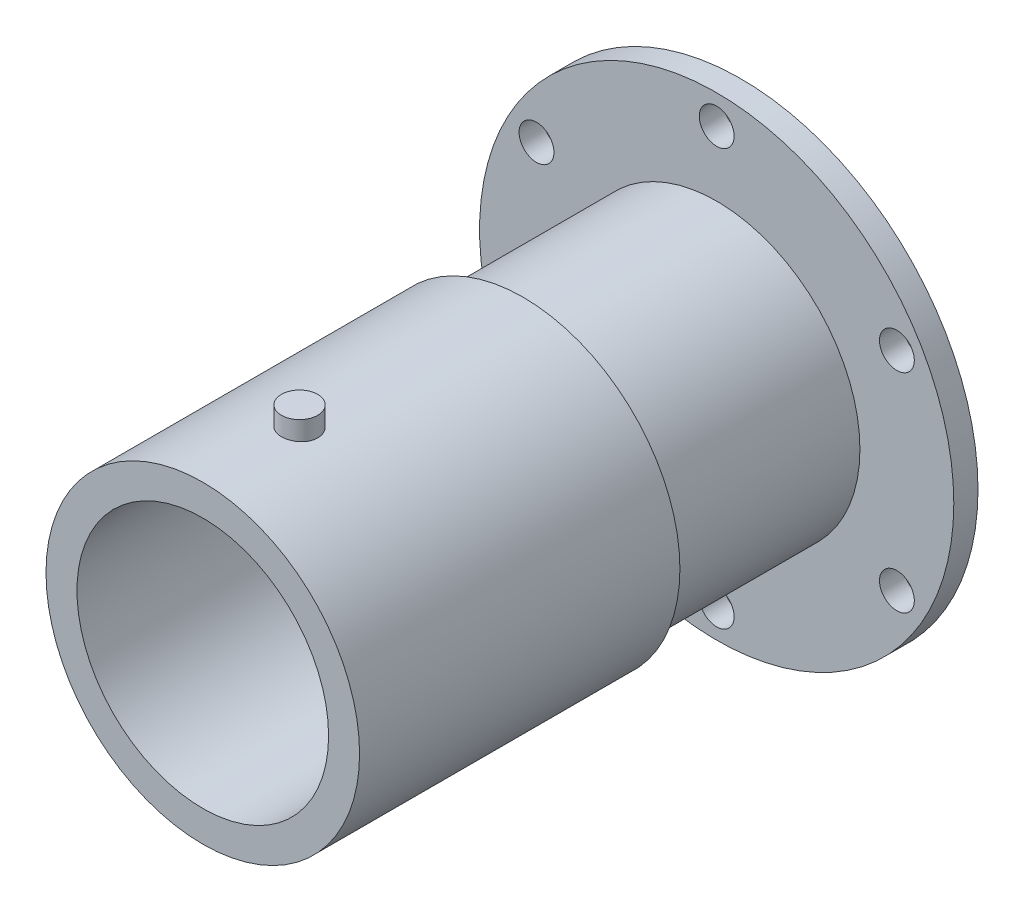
from build123d import *

# Parameters (mm, degrees)
SKETCH1_R                  = 62.23
EXTRUDE1_DEPTH             = 6.35
SKETCH2_R                  = 37.592
EXTRUDE2_DEPTH             = 50.8
SKETCH3_R                  = 41.148
EXTRUDE3_DEPTH             = 84.074
SKETCH7_R                  = 33.02
CUT_EXTRUDE2_DEPTH         = 53.34
EXTRUDE6_REACH             = 187.752
EXTRUDE6_END_RADIUS        = 41.148
SKETCH13_R                 = 4.7625
EXTRUDE6_DIRECTION_2_DEPTH = 4.8768
SKETCH12_R                 = 4.572
CUT_EXTRUDE5_DEPTH         = 162.047017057
CIRPATTERN1_COUNT          = 6


with BuildPart() as part:
    # Sketch1 → Extrude1 (new body)
    with BuildSketch(Plane.XY):
        Circle(SKETCH1_R)
    extrude(amount=EXTRUDE1_DEPTH)

    # Sketch12 → Cut-Extrude5 (cut, through all)
    with BuildSketch(Plane(origin=(0, 0, 6.35), x_dir=(-1, 0, 0), z_dir=(0, 0, -1))):
        with Locations((0, 54.61)):
            Circle(SKETCH12_R)
    cut_extrude5 = extrude(amount=CUT_EXTRUDE5_DEPTH, mode=Mode.SUBTRACT)

    # CirPattern1: Cut-Extrude5 ×6 about axis
    cirpattern1_axis = Axis((0, 0, 0), (0, 0, 1))
    for i in range(1, CIRPATTERN1_COUNT):
        add(cut_extrude5.rotate(cirpattern1_axis, i * 360 / CIRPATTERN1_COUNT), mode=Mode.SUBTRACT)


with BuildPart() as body_2:
    # Sketch2 → Extrude2 (new body)
    with BuildSketch(Plane.XY.offset(6.35)):
        Circle(SKETCH2_R)
    extrude(amount=EXTRUDE2_DEPTH)


with BuildPart() as body_3:
    # Sketch3 → Extrude3 (new body)
    with BuildSketch(Plane.XY.offset(57.15)):
        with Locations(Location((0, 0, 0), (0, 0, 180))):
            Circle(SKETCH3_R)
    extrude(amount=EXTRUDE3_DEPTH)

    # Sketch7 → Cut-Extrude2 (cut)
    with BuildSketch(Plane.XY.offset(141.224)):
        Circle(SKETCH7_R)
    extrude(amount=-CUT_EXTRUDE2_DEPTH, mode=Mode.SUBTRACT)

    # Extrude6: up to this cylinder (the profile starts outside it)
    extrude6_end = Plane(origin=(0, 0, 115.824), z_dir=(0, 0, -1)) * Cylinder(EXTRUDE6_END_RADIUS, 458.8, mode=Mode.PRIVATE)
    # Sketch13 → Extrude6 (add, up to the surface)
    with BuildSketch(Plane(origin=(0, 41.148, 0), x_dir=(-1, 0, 0), z_dir=(0, 1, 0)), mode=Mode.PRIVATE) as extrude6_sk1:
        with Locations(Location((0, 115.824, 0), (0, 0, 90))):
            Circle(SKETCH13_R)
    extrude6_tool1 = extrude(extrude6_sk1.sketch, amount=-EXTRUDE6_REACH, mode=Mode.PRIVATE) - extrude6_end
    add(extrude6_tool1.solids().sort_by_distance((0, 41.148, 115.824))[0])
    add(extrude6_tool1.solids().sort_by_distance((0, 41.148, 115.824))[1])

    # Sketch13 → Extrude6 direction 2 (add)
    with BuildSketch(Plane(origin=(0, 41.148, 0), x_dir=(-1, 0, 0), z_dir=(0, 1, 0))):
        with Locations(Location((0, 115.824, 0), (0, 0, 90))):
            Circle(SKETCH13_R)
    extrude(amount=EXTRUDE6_DIRECTION_2_DEPTH)


solid = Compound([part.part, body_2.part, body_3.part])
